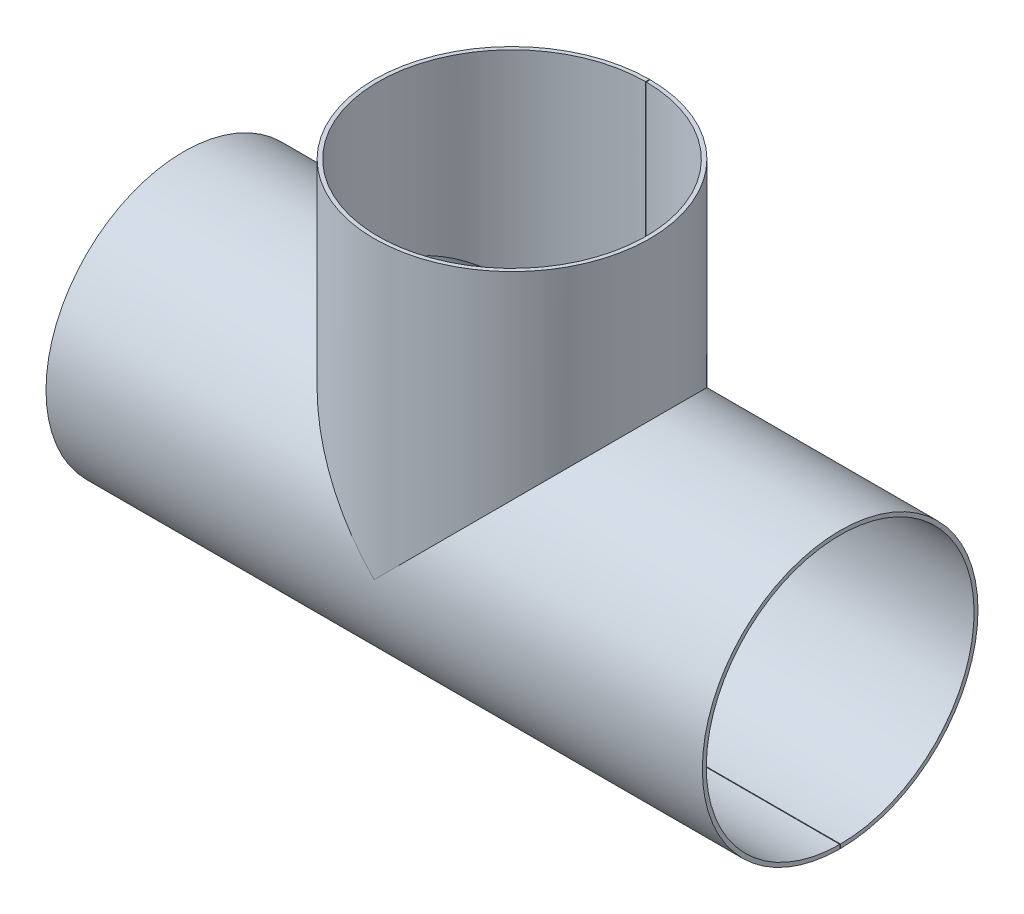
ISO-10303-21;
HEADER;
FILE_DESCRIPTION(('STEP AP214'),'2;1');
FILE_NAME('part.step','',(''),(''),'','','');
FILE_SCHEMA(('AUTOMOTIVE_DESIGN { 1 0 10303 214 1 1 1 1 }'));
ENDSEC;
DATA;
#1=APPLICATION_CONTEXT('core data for automotive mechanical design processes');
#2=APPLICATION_PROTOCOL_DEFINITION('international standard','automotive_design',2000,#1);
#3=PRODUCT_CONTEXT('',#1,'mechanical');
#4=PRODUCT('Part','Part','',(#3));
#5=PRODUCT_RELATED_PRODUCT_CATEGORY('part','',(#4));
#6=PRODUCT_DEFINITION_FORMATION('','',#4);
#7=PRODUCT_DEFINITION_CONTEXT('part definition',#1,'design');
#8=PRODUCT_DEFINITION('design','',#6,#7);
#9=PRODUCT_DEFINITION_SHAPE('','',#8);
#10=(LENGTH_UNIT() NAMED_UNIT(*) SI_UNIT(.MILLI.,.METRE.));
#11=(NAMED_UNIT(*) PLANE_ANGLE_UNIT() SI_UNIT($,.RADIAN.));
#12=(NAMED_UNIT(*) SI_UNIT($,.STERADIAN.) SOLID_ANGLE_UNIT());
#13=UNCERTAINTY_MEASURE_WITH_UNIT(LENGTH_MEASURE(1.E-05),#10,'distance_accuracy_value','');
#14=(GEOMETRIC_REPRESENTATION_CONTEXT(3) GLOBAL_UNCERTAINTY_ASSIGNED_CONTEXT((#13)) GLOBAL_UNIT_ASSIGNED_CONTEXT((#10,
#11,#12)) REPRESENTATION_CONTEXT('',''));
#15=CARTESIAN_POINT('',(0.,0.,0.));
#16=DIRECTION('',(0.,0.,1.));
#17=DIRECTION('',(1.,0.,0.));
#18=AXIS2_PLACEMENT_3D('',#15,#16,#17);
#19=CARTESIAN_POINT('',(500.,0.,0.));
#20=DIRECTION('',(-1.,0.,0.));
#21=DIRECTION('',(0.,0.,1.));
#22=AXIS2_PLACEMENT_3D('',#19,#20,#21);
#23=CYLINDRICAL_SURFACE('',#22,210.);
#24=CARTESIAN_POINT('',(0.,0.,0.));
#25=DIRECTION('',(-0.707106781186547,-0.707106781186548,0.));
#26=DIRECTION('',(-0.707106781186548,0.707106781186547,0.));
#27=AXIS2_PLACEMENT_3D('',#24,#25,#26);
#28=ELLIPSE('',#27,296.98484809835,210.);
#29=CARTESIAN_POINT('',(0.,0.,210.));
#30=VERTEX_POINT('',#29);
#31=CARTESIAN_POINT('',(0.,0.,-210.));
#32=VERTEX_POINT('',#31);
#33=EDGE_CURVE('E153',#30,#32,#28,.T.);
#34=ORIENTED_EDGE('',*,*,#33,.T.);
#35=CARTESIAN_POINT('',(-1.11022302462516E-13,0.,0.));
#36=DIRECTION('',(0.707106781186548,-0.707106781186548,0.));
#37=DIRECTION('',(-0.707106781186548,-0.707106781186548,0.));
#38=AXIS2_PLACEMENT_3D('',#35,#36,#37);
#39=ELLIPSE('',#38,296.98484809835,210.);
#40=EDGE_CURVE('E159',#32,#30,#39,.T.);
#41=ORIENTED_EDGE('',*,*,#40,.T.);
#42=EDGE_LOOP('',(#34,#41));
#43=FACE_BOUND('',#42,.T.);
#44=CARTESIAN_POINT('',(-500.,0.,0.));
#45=DIRECTION('',(1.,0.,0.));
#46=DIRECTION('',(0.,0.,-1.));
#47=AXIS2_PLACEMENT_3D('',#44,#45,#46);
#48=CIRCLE('',#47,210.);
#49=CARTESIAN_POINT('',(-500.,-209.999404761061,-0.5));
#50=VERTEX_POINT('',#49);
#51=CARTESIAN_POINT('',(-500.,-209.999404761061,0.5));
#52=VERTEX_POINT('',#51);
#53=EDGE_CURVE('E133',#50,#52,#48,.T.);
#54=ORIENTED_EDGE('',*,*,#53,.T.);
#55=DIRECTION('',(-1.,0.,0.));
#56=VECTOR('',#55,1.);
#57=CARTESIAN_POINT('',(500.,-209.999404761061,0.5));
#58=LINE('',#57,#56);
#59=CARTESIAN_POINT('',(500.,-209.999404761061,0.5));
#60=VERTEX_POINT('',#59);
#61=EDGE_CURVE('E74',#52,#60,#58,.F.);
#62=ORIENTED_EDGE('',*,*,#61,.T.);
#63=CARTESIAN_POINT('',(500.,0.,0.));
#64=DIRECTION('',(1.,0.,0.));
#65=DIRECTION('',(0.,0.,-1.));
#66=AXIS2_PLACEMENT_3D('',#63,#64,#65);
#67=CIRCLE('',#66,210.);
#68=CARTESIAN_POINT('',(500.,-209.999404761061,-0.5));
#69=VERTEX_POINT('',#68);
#70=EDGE_CURVE('E124',#69,#60,#67,.T.);
#71=ORIENTED_EDGE('',*,*,#70,.F.);
#72=DIRECTION('',(-1.,0.,0.));
#73=VECTOR('',#72,1.);
#74=CARTESIAN_POINT('',(500.,-209.999404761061,-0.5));
#75=LINE('',#74,#73);
#76=EDGE_CURVE('E109',#50,#69,#75,.F.);
#77=ORIENTED_EDGE('',*,*,#76,.F.);
#78=EDGE_LOOP('',(#54,#62,#71,#77));
#79=FACE_BOUND('',#78,.T.);
#80=ADVANCED_FACE('F60',(#43,#79),#23,.T.);
#81=CARTESIAN_POINT('',(500.,0.,0.));
#82=DIRECTION('',(1.,0.,0.));
#83=DIRECTION('',(0.,0.,-1.));
#84=AXIS2_PLACEMENT_3D('',#81,#82,#83);
#85=PLANE('',#84);
#86=DIRECTION('',(0.,1.,0.));
#87=VECTOR('',#86,1.);
#88=CARTESIAN_POINT('',(500.,-210.,0.5));
#89=LINE('',#88,#87);
#90=CARTESIAN_POINT('',(500.,-203.999387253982,0.5));
#91=VERTEX_POINT('',#90);
#92=EDGE_CURVE('E127',#60,#91,#89,.T.);
#93=ORIENTED_EDGE('',*,*,#92,.T.);
#94=CARTESIAN_POINT('',(500.,0.,0.));
#95=DIRECTION('',(1.,0.,0.));
#96=DIRECTION('',(0.,0.,-1.));
#97=AXIS2_PLACEMENT_3D('',#94,#95,#96);
#98=CIRCLE('',#97,204.);
#99=CARTESIAN_POINT('',(500.,-203.999387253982,-0.5));
#100=VERTEX_POINT('',#99);
#101=EDGE_CURVE('E126',#100,#91,#98,.T.);
#102=ORIENTED_EDGE('',*,*,#101,.F.);
#103=DIRECTION('',(0.,1.,0.));
#104=VECTOR('',#103,1.);
#105=CARTESIAN_POINT('',(500.,-210.,-0.5));
#106=LINE('',#105,#104);
#107=EDGE_CURVE('E112',#69,#100,#106,.T.);
#108=ORIENTED_EDGE('',*,*,#107,.F.);
#109=ORIENTED_EDGE('',*,*,#70,.T.);
#110=EDGE_LOOP('',(#93,#102,#108,#109));
#111=FACE_BOUND('',#110,.T.);
#112=ADVANCED_FACE('F123',(#111),#85,.T.);
#113=CARTESIAN_POINT('',(500.,0.,0.));
#114=DIRECTION('',(-1.,0.,0.));
#115=DIRECTION('',(0.,0.,1.));
#116=AXIS2_PLACEMENT_3D('',#113,#114,#115);
#117=CYLINDRICAL_SURFACE('',#116,204.);
#118=DIRECTION('',(-1.,0.,0.));
#119=VECTOR('',#118,1.);
#120=CARTESIAN_POINT('',(500.,-203.999387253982,0.5));
#121=LINE('',#120,#119);
#122=CARTESIAN_POINT('',(-500.,-203.999387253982,0.5));
#123=VERTEX_POINT('',#122);
#124=EDGE_CURVE('E117',#123,#91,#121,.F.);
#125=ORIENTED_EDGE('',*,*,#124,.F.);
#126=CARTESIAN_POINT('',(-500.,0.,0.));
#127=DIRECTION('',(1.,0.,0.));
#128=DIRECTION('',(0.,0.,-1.));
#129=AXIS2_PLACEMENT_3D('',#126,#127,#128);
#130=CIRCLE('',#129,204.);
#131=CARTESIAN_POINT('',(-500.,-203.999387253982,-0.5));
#132=VERTEX_POINT('',#131);
#133=EDGE_CURVE('E161',#132,#123,#130,.T.);
#134=ORIENTED_EDGE('',*,*,#133,.F.);
#135=DIRECTION('',(-1.,0.,0.));
#136=VECTOR('',#135,1.);
#137=CARTESIAN_POINT('',(500.,-203.999387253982,-0.5));
#138=LINE('',#137,#136);
#139=EDGE_CURVE('E81',#132,#100,#138,.F.);
#140=ORIENTED_EDGE('',*,*,#139,.T.);
#141=ORIENTED_EDGE('',*,*,#101,.T.);
#142=EDGE_LOOP('',(#125,#134,#140,#141));
#143=FACE_BOUND('',#142,.T.);
#144=CARTESIAN_POINT('',(-1.11022302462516E-13,0.,0.));
#145=DIRECTION('',(0.707106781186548,-0.707106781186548,0.));
#146=DIRECTION('',(-0.707106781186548,-0.707106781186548,0.));
#147=AXIS2_PLACEMENT_3D('',#144,#145,#146);
#148=ELLIPSE('',#147,288.499566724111,204.);
#149=CARTESIAN_POINT('',(0.,0.,-204.));
#150=VERTEX_POINT('',#149);
#151=CARTESIAN_POINT('',(0.,0.,204.));
#152=VERTEX_POINT('',#151);
#153=EDGE_CURVE('E131',#150,#152,#148,.T.);
#154=ORIENTED_EDGE('',*,*,#153,.F.);
#155=CARTESIAN_POINT('',(0.,0.,0.));
#156=DIRECTION('',(-0.707106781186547,-0.707106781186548,0.));
#157=DIRECTION('',(-0.707106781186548,0.707106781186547,0.));
#158=AXIS2_PLACEMENT_3D('',#155,#156,#157);
#159=ELLIPSE('',#158,288.499566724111,204.);
#160=EDGE_CURVE('E129',#152,#150,#159,.T.);
#161=ORIENTED_EDGE('',*,*,#160,.F.);
#162=EDGE_LOOP('',(#154,#161));
#163=FACE_BOUND('',#162,.T.);
#164=ADVANCED_FACE('F149',(#143,#163),#117,.F.);
#165=CARTESIAN_POINT('',(-500.,0.,0.));
#166=DIRECTION('',(1.,0.,0.));
#167=DIRECTION('',(0.,0.,-1.));
#168=AXIS2_PLACEMENT_3D('',#165,#166,#167);
#169=PLANE('',#168);
#170=ORIENTED_EDGE('',*,*,#133,.T.);
#171=DIRECTION('',(0.,-1.,0.));
#172=VECTOR('',#171,1.);
#173=CARTESIAN_POINT('',(-500.,0.,0.5));
#174=LINE('',#173,#172);
#175=EDGE_CURVE('E14',#123,#52,#174,.T.);
#176=ORIENTED_EDGE('',*,*,#175,.T.);
#177=ORIENTED_EDGE('',*,*,#53,.F.);
#178=DIRECTION('',(0.,-1.,0.));
#179=VECTOR('',#178,1.);
#180=CARTESIAN_POINT('',(-500.,0.,-0.5));
#181=LINE('',#180,#179);
#182=EDGE_CURVE('E67',#132,#50,#181,.T.);
#183=ORIENTED_EDGE('',*,*,#182,.F.);
#184=EDGE_LOOP('',(#170,#176,#177,#183));
#185=FACE_BOUND('',#184,.T.);
#186=ADVANCED_FACE('F164',(#185),#169,.F.);
#187=CARTESIAN_POINT('',(210.,210.,-210.));
#188=DIRECTION('',(0.707106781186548,-0.707106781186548,0.));
#189=DIRECTION('',(0.707106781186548,0.707106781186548,0.));
#190=AXIS2_PLACEMENT_3D('',#187,#188,#189);
#191=PLANE('',#190);
#192=DIRECTION('',(0.,0.,1.));
#193=VECTOR('',#192,1.);
#194=CARTESIAN_POINT('',(0.,0.,-210.));
#195=LINE('',#194,#193);
#196=EDGE_CURVE('E147',#32,#150,#195,.T.);
#197=ORIENTED_EDGE('',*,*,#196,.T.);
#198=ORIENTED_EDGE('',*,*,#153,.T.);
#199=EDGE_CURVE('E145',#152,#30,#195,.T.);
#200=ORIENTED_EDGE('',*,*,#199,.T.);
#201=ORIENTED_EDGE('',*,*,#40,.F.);
#202=EDGE_LOOP('',(#197,#198,#200,#201));
#203=FACE_BOUND('',#202,.T.);
#204=ADVANCED_FACE('F143',(#203),#191,.F.);
#205=CARTESIAN_POINT('',(0.,0.,-210.));
#206=DIRECTION('',(-0.707106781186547,-0.707106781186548,0.));
#207=DIRECTION('',(0.707106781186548,-0.707106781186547,0.));
#208=AXIS2_PLACEMENT_3D('',#205,#206,#207);
#209=PLANE('',#208);
#210=ORIENTED_EDGE('',*,*,#33,.F.);
#211=ORIENTED_EDGE('',*,*,#199,.F.);
#212=ORIENTED_EDGE('',*,*,#160,.T.);
#213=ORIENTED_EDGE('',*,*,#196,.F.);
#214=EDGE_LOOP('',(#210,#211,#212,#213));
#215=FACE_BOUND('',#214,.T.);
#216=ADVANCED_FACE('F152',(#215),#209,.F.);
#217=CARTESIAN_POINT('',(-500.,-210.,-0.5));
#218=DIRECTION('',(0.,0.,1.));
#219=DIRECTION('',(1.,0.,0.));
#220=AXIS2_PLACEMENT_3D('',#217,#218,#219);
#221=PLANE('',#220);
#222=ORIENTED_EDGE('',*,*,#76,.T.);
#223=ORIENTED_EDGE('',*,*,#107,.T.);
#224=ORIENTED_EDGE('',*,*,#139,.F.);
#225=ORIENTED_EDGE('',*,*,#182,.T.);
#226=EDGE_LOOP('',(#222,#223,#224,#225));
#227=FACE_BOUND('',#226,.T.);
#228=ADVANCED_FACE('F111',(#227),#221,.T.);
#229=CARTESIAN_POINT('',(-500.,-210.,0.5));
#230=DIRECTION('',(0.,0.,1.));
#231=DIRECTION('',(1.,0.,0.));
#232=AXIS2_PLACEMENT_3D('',#229,#230,#231);
#233=PLANE('',#232);
#234=ORIENTED_EDGE('',*,*,#175,.F.);
#235=ORIENTED_EDGE('',*,*,#124,.T.);
#236=ORIENTED_EDGE('',*,*,#92,.F.);
#237=ORIENTED_EDGE('',*,*,#61,.F.);
#238=EDGE_LOOP('',(#234,#235,#236,#237));
#239=FACE_BOUND('',#238,.T.);
#240=ADVANCED_FACE('F167',(#239),#233,.F.);
#241=CLOSED_SHELL('',(#80,#112,#164,#186,#204,#216,#228,#240));
#242=MANIFOLD_SOLID_BREP('B2',#241);
#243=CARTESIAN_POINT('',(0.,450.,0.));
#244=DIRECTION('',(0.,-1.,0.));
#245=DIRECTION('',(0.,0.,-1.));
#246=AXIS2_PLACEMENT_3D('',#243,#244,#245);
#247=CYLINDRICAL_SURFACE('',#246,210.);
#248=CARTESIAN_POINT('',(0.,0.,0.));
#249=DIRECTION('',(0.707106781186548,-0.707106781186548,0.));
#250=DIRECTION('',(-0.707106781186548,-0.707106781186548,0.));
#251=AXIS2_PLACEMENT_3D('',#248,#249,#250);
#252=ELLIPSE('',#251,296.98484809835,210.);
#253=CARTESIAN_POINT('',(0.5,0.5,-209.999404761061));
#254=VERTEX_POINT('',#253);
#255=CARTESIAN_POINT('',(0.,0.,210.));
#256=VERTEX_POINT('',#255);
#257=EDGE_CURVE('E305',#254,#256,#252,.T.);
#258=ORIENTED_EDGE('',*,*,#257,.F.);
#259=DIRECTION('',(0.,-1.,0.));
#260=VECTOR('',#259,1.);
#261=CARTESIAN_POINT('',(0.49999999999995,450.,-209.999404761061));
#262=LINE('',#261,#260);
#263=CARTESIAN_POINT('',(0.49999999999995,450.,-209.999404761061));
#264=VERTEX_POINT('',#263);
#265=EDGE_CURVE('E250',#254,#264,#262,.F.);
#266=ORIENTED_EDGE('',*,*,#265,.T.);
#267=CARTESIAN_POINT('',(0.,450.,0.));
#268=DIRECTION('',(0.,1.,0.));
#269=DIRECTION('',(0.,0.,1.));
#270=AXIS2_PLACEMENT_3D('',#267,#268,#269);
#271=CIRCLE('',#270,210.);
#272=CARTESIAN_POINT('',(-0.50000000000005,450.,-209.999404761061));
#273=VERTEX_POINT('',#272);
#274=EDGE_CURVE('E294',#273,#264,#271,.T.);
#275=ORIENTED_EDGE('',*,*,#274,.F.);
#276=DIRECTION('',(0.,-1.,0.));
#277=VECTOR('',#276,1.);
#278=CARTESIAN_POINT('',(-0.50000000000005,450.,-209.999404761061));
#279=LINE('',#278,#277);
#280=CARTESIAN_POINT('',(-0.5,0.5,-209.999404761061));
#281=VERTEX_POINT('',#280);
#282=EDGE_CURVE('E280',#281,#273,#279,.F.);
#283=ORIENTED_EDGE('',*,*,#282,.F.);
#284=CARTESIAN_POINT('',(0.,0.,0.));
#285=DIRECTION('',(-0.707106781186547,-0.707106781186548,0.));
#286=DIRECTION('',(0.707106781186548,-0.707106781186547,0.));
#287=AXIS2_PLACEMENT_3D('',#284,#285,#286);
#288=ELLIPSE('',#287,296.98484809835,210.);
#289=EDGE_CURVE('E314',#256,#281,#288,.T.);
#290=ORIENTED_EDGE('',*,*,#289,.F.);
#291=EDGE_LOOP('',(#258,#266,#275,#283,#290));
#292=FACE_BOUND('',#291,.T.);
#293=ADVANCED_FACE('F237',(#292),#247,.T.);
#294=CARTESIAN_POINT('',(0.,0.,-210.));
#295=DIRECTION('',(-0.707106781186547,-0.707106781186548,0.));
#296=DIRECTION('',(0.707106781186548,-0.707106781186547,0.));
#297=AXIS2_PLACEMENT_3D('',#294,#295,#296);
#298=PLANE('',#297);
#299=ORIENTED_EDGE('',*,*,#289,.T.);
#300=DIRECTION('',(0.,0.,1.));
#301=VECTOR('',#300,1.);
#302=CARTESIAN_POINT('',(-0.5,0.5,-210.));
#303=LINE('',#302,#301);
#304=CARTESIAN_POINT('',(-0.5,0.5,-203.999387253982));
#305=VERTEX_POINT('',#304);
#306=EDGE_CURVE('E244',#281,#305,#303,.T.);
#307=ORIENTED_EDGE('',*,*,#306,.T.);
#308=CARTESIAN_POINT('',(0.,0.,0.));
#309=DIRECTION('',(-0.707106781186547,-0.707106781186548,0.));
#310=DIRECTION('',(0.707106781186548,-0.707106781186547,0.));
#311=AXIS2_PLACEMENT_3D('',#308,#309,#310);
#312=ELLIPSE('',#311,288.499566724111,204.);
#313=CARTESIAN_POINT('',(0.,0.,204.));
#314=VERTEX_POINT('',#313);
#315=EDGE_CURVE('E300',#314,#305,#312,.T.);
#316=ORIENTED_EDGE('',*,*,#315,.F.);
#317=DIRECTION('',(0.,0.,1.));
#318=VECTOR('',#317,1.);
#319=CARTESIAN_POINT('',(0.,0.,-210.));
#320=LINE('',#319,#318);
#321=EDGE_CURVE('E322',#314,#256,#320,.T.);
#322=ORIENTED_EDGE('',*,*,#321,.T.);
#323=EDGE_LOOP('',(#299,#307,#316,#322));
#324=FACE_BOUND('',#323,.T.);
#325=ADVANCED_FACE('F311',(#324),#298,.T.);
#326=CARTESIAN_POINT('',(0.,450.,0.));
#327=DIRECTION('',(0.,-1.,0.));
#328=DIRECTION('',(0.,0.,-1.));
#329=AXIS2_PLACEMENT_3D('',#326,#327,#328);
#330=CYLINDRICAL_SURFACE('',#329,204.);
#331=DIRECTION('',(0.,-1.,0.));
#332=VECTOR('',#331,1.);
#333=CARTESIAN_POINT('',(0.49999999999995,450.,-203.999387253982));
#334=LINE('',#333,#332);
#335=CARTESIAN_POINT('',(0.5,0.5,-203.999387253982));
#336=VERTEX_POINT('',#335);
#337=CARTESIAN_POINT('',(0.49999999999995,450.,-203.999387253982));
#338=VERTEX_POINT('',#337);
#339=EDGE_CURVE('E319',#336,#338,#334,.F.);
#340=ORIENTED_EDGE('',*,*,#339,.F.);
#341=CARTESIAN_POINT('',(0.,0.,0.));
#342=DIRECTION('',(0.707106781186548,-0.707106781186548,0.));
#343=DIRECTION('',(-0.707106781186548,-0.707106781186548,0.));
#344=AXIS2_PLACEMENT_3D('',#341,#342,#343);
#345=ELLIPSE('',#344,288.499566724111,204.);
#346=EDGE_CURVE('E303',#336,#314,#345,.T.);
#347=ORIENTED_EDGE('',*,*,#346,.T.);
#348=ORIENTED_EDGE('',*,*,#315,.T.);
#349=DIRECTION('',(0.,-1.,0.));
#350=VECTOR('',#349,1.);
#351=CARTESIAN_POINT('',(-0.50000000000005,450.,-203.999387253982));
#352=LINE('',#351,#350);
#353=CARTESIAN_POINT('',(-0.50000000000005,450.,-203.999387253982));
#354=VERTEX_POINT('',#353);
#355=EDGE_CURVE('E258',#305,#354,#352,.F.);
#356=ORIENTED_EDGE('',*,*,#355,.T.);
#357=CARTESIAN_POINT('',(0.,450.,0.));
#358=DIRECTION('',(0.,1.,0.));
#359=DIRECTION('',(1.,0.,0.));
#360=AXIS2_PLACEMENT_3D('',#357,#358,#359);
#361=CIRCLE('',#360,204.);
#362=EDGE_CURVE('E296',#354,#338,#361,.T.);
#363=ORIENTED_EDGE('',*,*,#362,.T.);
#364=EDGE_LOOP('',(#340,#347,#348,#356,#363));
#365=FACE_BOUND('',#364,.T.);
#366=ADVANCED_FACE('F317',(#365),#330,.F.);
#367=CARTESIAN_POINT('',(0.,450.,0.));
#368=DIRECTION('',(0.,1.,0.));
#369=DIRECTION('',(0.,0.,1.));
#370=AXIS2_PLACEMENT_3D('',#367,#368,#369);
#371=PLANE('',#370);
#372=DIRECTION('',(0.,0.,1.));
#373=VECTOR('',#372,1.);
#374=CARTESIAN_POINT('',(0.49999999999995,450.,-210.));
#375=LINE('',#374,#373);
#376=EDGE_CURVE('E297',#264,#338,#375,.T.);
#377=ORIENTED_EDGE('',*,*,#376,.T.);
#378=ORIENTED_EDGE('',*,*,#362,.F.);
#379=DIRECTION('',(0.,0.,1.));
#380=VECTOR('',#379,1.);
#381=CARTESIAN_POINT('',(-0.50000000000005,450.,-210.));
#382=LINE('',#381,#380);
#383=EDGE_CURVE('E283',#273,#354,#382,.T.);
#384=ORIENTED_EDGE('',*,*,#383,.F.);
#385=ORIENTED_EDGE('',*,*,#274,.T.);
#386=EDGE_LOOP('',(#377,#378,#384,#385));
#387=FACE_BOUND('',#386,.T.);
#388=ADVANCED_FACE('F293',(#387),#371,.T.);
#389=CARTESIAN_POINT('',(210.,210.,-210.));
#390=DIRECTION('',(0.707106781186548,-0.707106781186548,0.));
#391=DIRECTION('',(0.707106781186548,0.707106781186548,0.));
#392=AXIS2_PLACEMENT_3D('',#389,#390,#391);
#393=PLANE('',#392);
#394=DIRECTION('',(0.,0.,1.));
#395=VECTOR('',#394,1.);
#396=CARTESIAN_POINT('',(0.5,0.5,-210.));
#397=LINE('',#396,#395);
#398=EDGE_CURVE('E58',#254,#336,#397,.T.);
#399=ORIENTED_EDGE('',*,*,#398,.F.);
#400=ORIENTED_EDGE('',*,*,#257,.T.);
#401=ORIENTED_EDGE('',*,*,#321,.F.);
#402=ORIENTED_EDGE('',*,*,#346,.F.);
#403=EDGE_LOOP('',(#399,#400,#401,#402));
#404=FACE_BOUND('',#403,.T.);
#405=ADVANCED_FACE('F321',(#404),#393,.T.);
#406=CARTESIAN_POINT('',(-0.5,0.,-210.));
#407=DIRECTION('',(1.,0.,0.));
#408=DIRECTION('',(0.,1.,0.));
#409=AXIS2_PLACEMENT_3D('',#406,#407,#408);
#410=PLANE('',#409);
#411=ORIENTED_EDGE('',*,*,#306,.F.);
#412=ORIENTED_EDGE('',*,*,#282,.T.);
#413=ORIENTED_EDGE('',*,*,#383,.T.);
#414=ORIENTED_EDGE('',*,*,#355,.F.);
#415=EDGE_LOOP('',(#411,#412,#413,#414));
#416=FACE_BOUND('',#415,.T.);
#417=ADVANCED_FACE('F282',(#416),#410,.T.);
#418=CARTESIAN_POINT('',(0.5,0.,-210.));
#419=DIRECTION('',(1.,0.,0.));
#420=DIRECTION('',(0.,1.,0.));
#421=AXIS2_PLACEMENT_3D('',#418,#419,#420);
#422=PLANE('',#421);
#423=ORIENTED_EDGE('',*,*,#339,.T.);
#424=ORIENTED_EDGE('',*,*,#376,.F.);
#425=ORIENTED_EDGE('',*,*,#265,.F.);
#426=ORIENTED_EDGE('',*,*,#398,.T.);
#427=EDGE_LOOP('',(#423,#424,#425,#426));
#428=FACE_BOUND('',#427,.T.);
#429=ADVANCED_FACE('F329',(#428),#422,.F.);
#430=CLOSED_SHELL('',(#293,#325,#366,#388,#405,#417,#429));
#431=MANIFOLD_SOLID_BREP('B8',#430);
#432=ADVANCED_BREP_SHAPE_REPRESENTATION('',(#18,#242,#431),#14);
#433=SHAPE_DEFINITION_REPRESENTATION(#9,#432);
ENDSEC;
END-ISO-10303-21;
